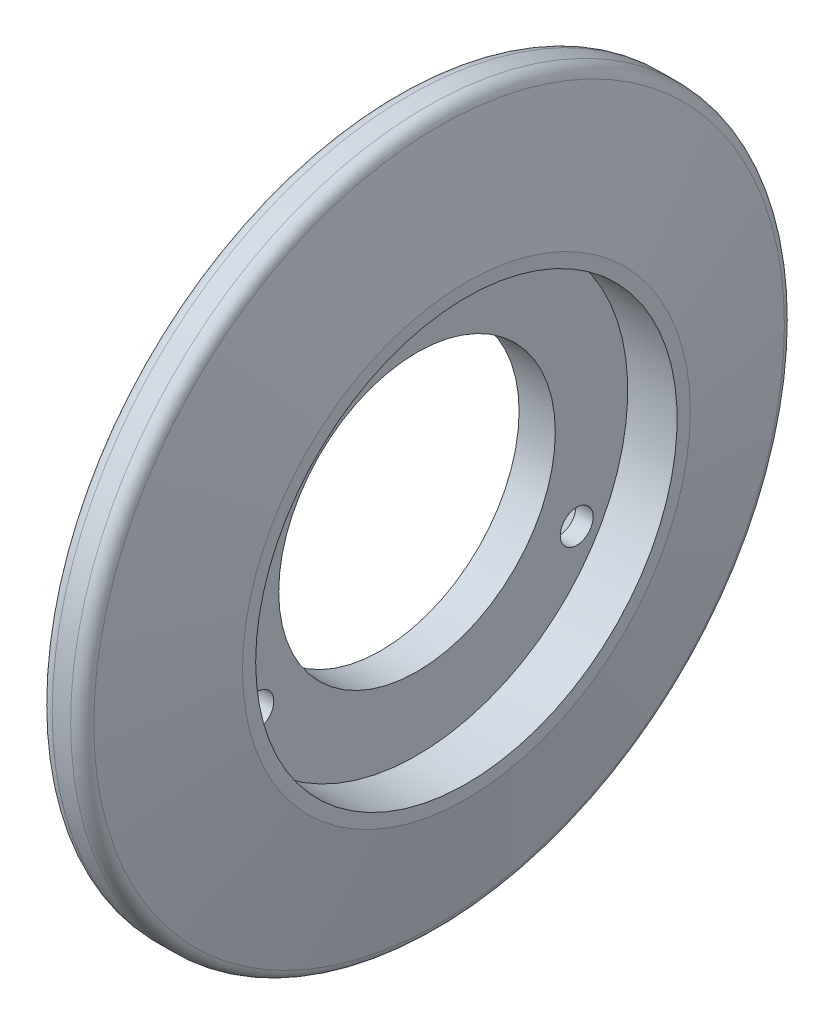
ISO-10303-21;
HEADER;
FILE_DESCRIPTION(('STEP AP214'),'2;1');
FILE_NAME('part.step','',(''),(''),'','','');
FILE_SCHEMA(('AUTOMOTIVE_DESIGN { 1 0 10303 214 1 1 1 1 }'));
ENDSEC;
DATA;
#1=APPLICATION_CONTEXT('core data for automotive mechanical design processes');
#2=APPLICATION_PROTOCOL_DEFINITION('international standard','automotive_design',2000,#1);
#3=PRODUCT_CONTEXT('',#1,'mechanical');
#4=PRODUCT('Part','Part','',(#3));
#5=PRODUCT_RELATED_PRODUCT_CATEGORY('part','',(#4));
#6=PRODUCT_DEFINITION_FORMATION('','',#4);
#7=PRODUCT_DEFINITION_CONTEXT('part definition',#1,'design');
#8=PRODUCT_DEFINITION('design','',#6,#7);
#9=PRODUCT_DEFINITION_SHAPE('','',#8);
#10=(LENGTH_UNIT() NAMED_UNIT(*) SI_UNIT(.MILLI.,.METRE.));
#11=(NAMED_UNIT(*) PLANE_ANGLE_UNIT() SI_UNIT($,.RADIAN.));
#12=(NAMED_UNIT(*) SI_UNIT($,.STERADIAN.) SOLID_ANGLE_UNIT());
#13=UNCERTAINTY_MEASURE_WITH_UNIT(LENGTH_MEASURE(1.E-05),#10,'distance_accuracy_value','');
#14=(GEOMETRIC_REPRESENTATION_CONTEXT(3) GLOBAL_UNCERTAINTY_ASSIGNED_CONTEXT((#13)) GLOBAL_UNIT_ASSIGNED_CONTEXT((#10,
#11,#12)) REPRESENTATION_CONTEXT('',''));
#15=CARTESIAN_POINT('',(0.,0.,0.));
#16=DIRECTION('',(0.,0.,1.));
#17=DIRECTION('',(1.,0.,0.));
#18=AXIS2_PLACEMENT_3D('',#15,#16,#17);
#19=CARTESIAN_POINT('',(5.50000000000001,-33.,0.));
#20=DIRECTION('',(-1.,0.,0.));
#21=DIRECTION('',(0.,0.,1.));
#22=AXIS2_PLACEMENT_3D('',#19,#20,#21);
#23=PLANE('',#22);
#24=CARTESIAN_POINT('',(5.50000000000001,0.,0.));
#25=DIRECTION('',(-1.,0.,0.));
#26=DIRECTION('',(0.,0.,1.));
#27=AXIS2_PLACEMENT_3D('',#24,#25,#26);
#28=CIRCLE('',#27,34.);
#29=CARTESIAN_POINT('',(5.50000000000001,0.,34.));
#30=VERTEX_POINT('',#29);
#31=EDGE_CURVE('E105',#30,#30,#28,.T.);
#32=ORIENTED_EDGE('',*,*,#31,.T.);
#33=EDGE_LOOP('',(#32));
#34=FACE_BOUND('',#33,.T.);
#35=CARTESIAN_POINT('',(5.50000000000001,0.,0.));
#36=DIRECTION('',(-1.,0.,0.));
#37=DIRECTION('',(0.,0.,1.));
#38=AXIS2_PLACEMENT_3D('',#35,#36,#37);
#39=CIRCLE('',#38,33.);
#40=CARTESIAN_POINT('',(5.50000000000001,0.,33.));
#41=VERTEX_POINT('',#40);
#42=EDGE_CURVE('E72',#41,#41,#39,.T.);
#43=ORIENTED_EDGE('',*,*,#42,.F.);
#44=EDGE_LOOP('',(#43));
#45=FACE_BOUND('',#44,.T.);
#46=ADVANCED_FACE('F35',(#34,#45),#23,.T.);
#47=CARTESIAN_POINT('',(5.50000000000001,0.,0.));
#48=DIRECTION('',(1.,0.,0.));
#49=DIRECTION('',(0.,0.,-1.));
#50=AXIS2_PLACEMENT_3D('',#47,#48,#49);
#51=CONICAL_SURFACE('',#50,34.,1.34948188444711);
#52=CARTESIAN_POINT('',(9.64878048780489,0.,0.));
#53=DIRECTION('',(-1.,0.,0.));
#54=DIRECTION('',(0.,0.,1.));
#55=AXIS2_PLACEMENT_3D('',#52,#53,#54);
#56=CIRCLE('',#55,52.4390243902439);
#57=CARTESIAN_POINT('',(9.64878048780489,0.,52.4390243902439));
#58=VERTEX_POINT('',#57);
#59=EDGE_CURVE('E11',#58,#58,#56,.T.);
#60=ORIENTED_EDGE('',*,*,#59,.T.);
#61=EDGE_LOOP('',(#60));
#62=FACE_BOUND('',#61,.T.);
#63=ORIENTED_EDGE('',*,*,#31,.F.);
#64=EDGE_LOOP('',(#63));
#65=FACE_BOUND('',#64,.T.);
#66=ADVANCED_FACE('F152',(#62,#65),#51,.T.);
#67=CARTESIAN_POINT('',(-40.,0.,0.));
#68=DIRECTION('',(-1.,0.,0.));
#69=DIRECTION('',(0.,0.,1.));
#70=AXIS2_PLACEMENT_3D('',#67,#68,#69);
#71=CYLINDRICAL_SURFACE('',#70,54.);
#72=CARTESIAN_POINT('',(14.4,0.,0.));
#73=DIRECTION('',(1.,0.,0.));
#74=DIRECTION('',(0.,0.,-1.));
#75=AXIS2_PLACEMENT_3D('',#72,#73,#74);
#76=CIRCLE('',#75,54.);
#77=CARTESIAN_POINT('',(14.4,0.,-54.));
#78=VERTEX_POINT('',#77);
#79=EDGE_CURVE('E111',#78,#78,#76,.F.);
#80=ORIENTED_EDGE('',*,*,#79,.T.);
#81=EDGE_LOOP('',(#80));
#82=FACE_BOUND('',#81,.T.);
#83=CARTESIAN_POINT('',(11.6,0.,0.));
#84=DIRECTION('',(1.,0.,0.));
#85=DIRECTION('',(0.,0.,-1.));
#86=AXIS2_PLACEMENT_3D('',#83,#84,#85);
#87=CIRCLE('',#86,54.);
#88=CARTESIAN_POINT('',(11.6,0.,-54.));
#89=VERTEX_POINT('',#88);
#90=EDGE_CURVE('E108',#89,#89,#87,.T.);
#91=ORIENTED_EDGE('',*,*,#90,.T.);
#92=EDGE_LOOP('',(#91));
#93=FACE_BOUND('',#92,.T.);
#94=ADVANCED_FACE('F146',(#82,#93),#71,.T.);
#95=CARTESIAN_POINT('',(16.,0.,0.));
#96=DIRECTION('',(-1.,0.,0.));
#97=DIRECTION('',(0.,0.,1.));
#98=AXIS2_PLACEMENT_3D('',#95,#96,#97);
#99=CONICAL_SURFACE('',#98,54.,1.34948188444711);
#100=CARTESIAN_POINT('',(16.3512195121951,0.,0.));
#101=DIRECTION('',(1.,0.,0.));
#102=DIRECTION('',(0.,0.,-1.));
#103=AXIS2_PLACEMENT_3D('',#100,#101,#102);
#104=CIRCLE('',#103,52.4390243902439);
#105=CARTESIAN_POINT('',(16.3512195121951,0.,-52.4390243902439));
#106=VERTEX_POINT('',#105);
#107=EDGE_CURVE('E44',#106,#106,#104,.T.);
#108=ORIENTED_EDGE('',*,*,#107,.T.);
#109=EDGE_LOOP('',(#108));
#110=FACE_BOUND('',#109,.T.);
#111=CARTESIAN_POINT('',(20.5,0.,0.));
#112=DIRECTION('',(-1.,0.,0.));
#113=DIRECTION('',(0.,0.,1.));
#114=AXIS2_PLACEMENT_3D('',#111,#112,#113);
#115=CIRCLE('',#114,34.);
#116=CARTESIAN_POINT('',(20.5,0.,34.));
#117=VERTEX_POINT('',#116);
#118=EDGE_CURVE('E102',#117,#117,#115,.T.);
#119=ORIENTED_EDGE('',*,*,#118,.T.);
#120=EDGE_LOOP('',(#119));
#121=FACE_BOUND('',#120,.T.);
#122=ADVANCED_FACE('F141',(#110,#121),#99,.T.);
#123=CARTESIAN_POINT('',(20.5,-34.,0.));
#124=DIRECTION('',(1.,0.,0.));
#125=DIRECTION('',(0.,0.,-1.));
#126=AXIS2_PLACEMENT_3D('',#123,#124,#125);
#127=PLANE('',#126);
#128=CARTESIAN_POINT('',(20.5,0.,0.));
#129=DIRECTION('',(-1.,0.,0.));
#130=DIRECTION('',(0.,0.,1.));
#131=AXIS2_PLACEMENT_3D('',#128,#129,#130);
#132=CIRCLE('',#131,32.);
#133=CARTESIAN_POINT('',(20.5,0.,32.));
#134=VERTEX_POINT('',#133);
#135=EDGE_CURVE('E99',#134,#134,#132,.T.);
#136=ORIENTED_EDGE('',*,*,#135,.T.);
#137=EDGE_LOOP('',(#136));
#138=FACE_BOUND('',#137,.T.);
#139=ORIENTED_EDGE('',*,*,#118,.F.);
#140=EDGE_LOOP('',(#139));
#141=FACE_BOUND('',#140,.T.);
#142=ADVANCED_FACE('F135',(#138,#141),#127,.T.);
#143=CARTESIAN_POINT('',(-40.,0.,0.));
#144=DIRECTION('',(-1.,0.,0.));
#145=DIRECTION('',(0.,0.,1.));
#146=AXIS2_PLACEMENT_3D('',#143,#144,#145);
#147=CYLINDRICAL_SURFACE('',#146,32.);
#148=CARTESIAN_POINT('',(13.,0.,0.));
#149=DIRECTION('',(-1.,0.,0.));
#150=DIRECTION('',(0.,0.,1.));
#151=AXIS2_PLACEMENT_3D('',#148,#149,#150);
#152=CIRCLE('',#151,32.);
#153=CARTESIAN_POINT('',(13.,0.,32.));
#154=VERTEX_POINT('',#153);
#155=EDGE_CURVE('E96',#154,#154,#152,.T.);
#156=ORIENTED_EDGE('',*,*,#155,.T.);
#157=EDGE_LOOP('',(#156));
#158=FACE_BOUND('',#157,.T.);
#159=ORIENTED_EDGE('',*,*,#135,.F.);
#160=EDGE_LOOP('',(#159));
#161=FACE_BOUND('',#160,.T.);
#162=ADVANCED_FACE('F126',(#158,#161),#147,.F.);
#163=CARTESIAN_POINT('',(13.,-32.,0.));
#164=DIRECTION('',(1.,0.,0.));
#165=DIRECTION('',(0.,0.,-1.));
#166=AXIS2_PLACEMENT_3D('',#163,#164,#165);
#167=PLANE('',#166);
#168=CARTESIAN_POINT('',(13.,-13.9999999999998,24.2487113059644));
#169=DIRECTION('',(1.,0.,0.));
#170=DIRECTION('',(0.,0.,-1.));
#171=AXIS2_PLACEMENT_3D('',#168,#169,#170);
#172=CIRCLE('',#171,2.50000000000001);
#173=CARTESIAN_POINT('',(13.,-13.9999999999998,21.7487113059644));
#174=VERTEX_POINT('',#173);
#175=EDGE_CURVE('E39',#174,#174,#172,.T.);
#176=ORIENTED_EDGE('',*,*,#175,.F.);
#177=EDGE_LOOP('',(#176));
#178=FACE_BOUND('',#177,.T.);
#179=CARTESIAN_POINT('',(13.,-14.0000000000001,-24.2487113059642));
#180=DIRECTION('',(1.,0.,0.));
#181=DIRECTION('',(0.,0.,-1.));
#182=AXIS2_PLACEMENT_3D('',#179,#180,#181);
#183=CIRCLE('',#182,2.50000000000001);
#184=CARTESIAN_POINT('',(13.,-14.0000000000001,-26.7487113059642));
#185=VERTEX_POINT('',#184);
#186=EDGE_CURVE('E78',#185,#185,#183,.T.);
#187=ORIENTED_EDGE('',*,*,#186,.F.);
#188=EDGE_LOOP('',(#187));
#189=FACE_BOUND('',#188,.T.);
#190=CARTESIAN_POINT('',(13.,28.,0.));
#191=DIRECTION('',(1.,0.,0.));
#192=DIRECTION('',(0.,0.,-1.));
#193=AXIS2_PLACEMENT_3D('',#190,#191,#192);
#194=CIRCLE('',#193,2.50000000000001);
#195=CARTESIAN_POINT('',(13.,28.,-2.50000000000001));
#196=VERTEX_POINT('',#195);
#197=EDGE_CURVE('E81',#196,#196,#194,.T.);
#198=ORIENTED_EDGE('',*,*,#197,.F.);
#199=EDGE_LOOP('',(#198));
#200=FACE_BOUND('',#199,.T.);
#201=CARTESIAN_POINT('',(13.,0.,0.));
#202=DIRECTION('',(-1.,0.,0.));
#203=DIRECTION('',(0.,0.,1.));
#204=AXIS2_PLACEMENT_3D('',#201,#202,#203);
#205=CIRCLE('',#204,21.);
#206=CARTESIAN_POINT('',(13.,0.,21.));
#207=VERTEX_POINT('',#206);
#208=EDGE_CURVE('E93',#207,#207,#205,.T.);
#209=ORIENTED_EDGE('',*,*,#208,.T.);
#210=EDGE_LOOP('',(#209));
#211=FACE_BOUND('',#210,.T.);
#212=ORIENTED_EDGE('',*,*,#155,.F.);
#213=EDGE_LOOP('',(#212));
#214=FACE_BOUND('',#213,.T.);
#215=ADVANCED_FACE('F122',(#178,#189,#200,#211,#214),#167,.T.);
#216=CARTESIAN_POINT('',(-40.,0.,0.));
#217=DIRECTION('',(-1.,0.,0.));
#218=DIRECTION('',(0.,0.,1.));
#219=AXIS2_PLACEMENT_3D('',#216,#217,#218);
#220=CYLINDRICAL_SURFACE('',#219,21.);
#221=CARTESIAN_POINT('',(7.50000000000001,0.,0.));
#222=DIRECTION('',(-1.,0.,0.));
#223=DIRECTION('',(0.,0.,1.));
#224=AXIS2_PLACEMENT_3D('',#221,#222,#223);
#225=CIRCLE('',#224,21.);
#226=CARTESIAN_POINT('',(7.50000000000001,0.,21.));
#227=VERTEX_POINT('',#226);
#228=EDGE_CURVE('E90',#227,#227,#225,.T.);
#229=ORIENTED_EDGE('',*,*,#228,.T.);
#230=EDGE_LOOP('',(#229));
#231=FACE_BOUND('',#230,.T.);
#232=ORIENTED_EDGE('',*,*,#208,.F.);
#233=EDGE_LOOP('',(#232));
#234=FACE_BOUND('',#233,.T.);
#235=ADVANCED_FACE('F125',(#231,#234),#220,.F.);
#236=CARTESIAN_POINT('',(7.50000000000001,-21.,0.));
#237=DIRECTION('',(-1.,0.,0.));
#238=DIRECTION('',(0.,0.,1.));
#239=AXIS2_PLACEMENT_3D('',#236,#237,#238);
#240=PLANE('',#239);
#241=CARTESIAN_POINT('',(7.50000000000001,0.,0.));
#242=DIRECTION('',(-1.,0.,0.));
#243=DIRECTION('',(0.,0.,1.));
#244=AXIS2_PLACEMENT_3D('',#241,#242,#243);
#245=CIRCLE('',#244,33.);
#246=CARTESIAN_POINT('',(7.50000000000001,-16.5000000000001,-28.5788383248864));
#247=VERTEX_POINT('',#246);
#248=CARTESIAN_POINT('',(7.50000000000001,-16.4999999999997,28.5788383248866));
#249=VERTEX_POINT('',#248);
#250=EDGE_CURVE('E71',#247,#249,#245,.T.);
#251=ORIENTED_EDGE('',*,*,#250,.T.);
#252=CARTESIAN_POINT('',(7.50000000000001,-13.9999999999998,24.2487113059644));
#253=DIRECTION('',(-1.,0.,0.));
#254=DIRECTION('',(0.,0.,1.));
#255=AXIS2_PLACEMENT_3D('',#252,#253,#254);
#256=CIRCLE('',#255,5.);
#257=EDGE_CURVE('E50',#249,#249,#256,.T.);
#258=ORIENTED_EDGE('',*,*,#257,.F.);
#259=CARTESIAN_POINT('',(7.50000000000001,33.,0.));
#260=VERTEX_POINT('',#259);
#261=EDGE_CURVE('E61',#249,#260,#245,.T.);
#262=ORIENTED_EDGE('',*,*,#261,.T.);
#263=CARTESIAN_POINT('',(7.50000000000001,28.,0.));
#264=DIRECTION('',(-1.,0.,0.));
#265=DIRECTION('',(0.,0.,1.));
#266=AXIS2_PLACEMENT_3D('',#263,#264,#265);
#267=CIRCLE('',#266,5.);
#268=EDGE_CURVE('E67',#260,#260,#267,.T.);
#269=ORIENTED_EDGE('',*,*,#268,.F.);
#270=EDGE_CURVE('E74',#260,#247,#245,.T.);
#271=ORIENTED_EDGE('',*,*,#270,.T.);
#272=CARTESIAN_POINT('',(7.50000000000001,-14.0000000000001,-24.2487113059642));
#273=DIRECTION('',(-1.,0.,0.));
#274=DIRECTION('',(0.,0.,1.));
#275=AXIS2_PLACEMENT_3D('',#272,#273,#274);
#276=CIRCLE('',#275,5.);
#277=EDGE_CURVE('E55',#247,#247,#276,.T.);
#278=ORIENTED_EDGE('',*,*,#277,.F.);
#279=EDGE_LOOP('',(#251,#258,#262,#269,#271,#278));
#280=FACE_BOUND('',#279,.T.);
#281=ORIENTED_EDGE('',*,*,#228,.F.);
#282=EDGE_LOOP('',(#281));
#283=FACE_BOUND('',#282,.T.);
#284=ADVANCED_FACE('F64',(#280,#283),#240,.T.);
#285=CARTESIAN_POINT('',(-40.,0.,0.));
#286=DIRECTION('',(-1.,0.,0.));
#287=DIRECTION('',(0.,0.,1.));
#288=AXIS2_PLACEMENT_3D('',#285,#286,#287);
#289=CYLINDRICAL_SURFACE('',#288,33.);
#290=ORIENTED_EDGE('',*,*,#42,.T.);
#291=EDGE_LOOP('',(#290));
#292=FACE_BOUND('',#291,.T.);
#293=ORIENTED_EDGE('',*,*,#270,.F.);
#294=ORIENTED_EDGE('',*,*,#261,.F.);
#295=ORIENTED_EDGE('',*,*,#250,.F.);
#296=EDGE_LOOP('',(#293,#294,#295));
#297=FACE_BOUND('',#296,.T.);
#298=ADVANCED_FACE('F166',(#292,#297),#289,.F.);
#299=CARTESIAN_POINT('',(14.4,0.,0.));
#300=DIRECTION('',(1.,0.,0.));
#301=DIRECTION('',(0.,0.,-1.));
#302=AXIS2_PLACEMENT_3D('',#299,#300,#301);
#303=TOROIDAL_SURFACE('',#302,52.,2.);
#304=ORIENTED_EDGE('',*,*,#107,.F.);
#305=EDGE_LOOP('',(#304));
#306=FACE_BOUND('',#305,.T.);
#307=ORIENTED_EDGE('',*,*,#79,.F.);
#308=EDGE_LOOP('',(#307));
#309=FACE_BOUND('',#308,.T.);
#310=ADVANCED_FACE('F164',(#306,#309),#303,.T.);
#311=CARTESIAN_POINT('',(11.6,0.,0.));
#312=DIRECTION('',(1.,0.,0.));
#313=DIRECTION('',(0.,0.,-1.));
#314=AXIS2_PLACEMENT_3D('',#311,#312,#313);
#315=TOROIDAL_SURFACE('',#314,52.,2.);
#316=ORIENTED_EDGE('',*,*,#90,.F.);
#317=EDGE_LOOP('',(#316));
#318=FACE_BOUND('',#317,.T.);
#319=ORIENTED_EDGE('',*,*,#59,.F.);
#320=EDGE_LOOP('',(#319));
#321=FACE_BOUND('',#320,.T.);
#322=ADVANCED_FACE('F37',(#318,#321),#315,.T.);
#323=CARTESIAN_POINT('',(7.50000000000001,28.,0.));
#324=DIRECTION('',(-1.,0.,0.));
#325=DIRECTION('',(0.,0.,1.));
#326=AXIS2_PLACEMENT_3D('',#323,#324,#325);
#327=CYLINDRICAL_SURFACE('',#326,2.50000000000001);
#328=ORIENTED_EDGE('',*,*,#197,.T.);
#329=EDGE_LOOP('',(#328));
#330=FACE_BOUND('',#329,.T.);
#331=CARTESIAN_POINT('',(10.3759210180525,28.,0.));
#332=DIRECTION('',(-1.,0.,0.));
#333=DIRECTION('',(0.,0.,1.));
#334=AXIS2_PLACEMENT_3D('',#331,#332,#333);
#335=CIRCLE('',#334,2.50000000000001);
#336=CARTESIAN_POINT('',(10.3759210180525,28.,2.50000000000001));
#337=VERTEX_POINT('',#336);
#338=EDGE_CURVE('E77',#337,#337,#335,.T.);
#339=ORIENTED_EDGE('',*,*,#338,.T.);
#340=EDGE_LOOP('',(#339));
#341=FACE_BOUND('',#340,.T.);
#342=ADVANCED_FACE('F119',(#330,#341),#327,.F.);
#343=CARTESIAN_POINT('',(7.50000000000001,28.,0.));
#344=DIRECTION('',(-1.,0.,0.));
#345=DIRECTION('',(0.,0.,1.));
#346=AXIS2_PLACEMENT_3D('',#343,#344,#345);
#347=CONICAL_SURFACE('',#346,5.,0.715584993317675);
#348=ORIENTED_EDGE('',*,*,#338,.F.);
#349=EDGE_LOOP('',(#348));
#350=FACE_BOUND('',#349,.T.);
#351=ORIENTED_EDGE('',*,*,#268,.T.);
#352=EDGE_LOOP('',(#351));
#353=FACE_BOUND('',#352,.T.);
#354=ADVANCED_FACE('F76',(#350,#353),#347,.F.);
#355=CARTESIAN_POINT('',(7.50000000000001,-14.0000000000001,-24.2487113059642));
#356=DIRECTION('',(-1.,0.,0.));
#357=DIRECTION('',(0.,0.,1.));
#358=AXIS2_PLACEMENT_3D('',#355,#356,#357);
#359=CYLINDRICAL_SURFACE('',#358,2.50000000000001);
#360=ORIENTED_EDGE('',*,*,#186,.T.);
#361=EDGE_LOOP('',(#360));
#362=FACE_BOUND('',#361,.T.);
#363=CARTESIAN_POINT('',(10.3759210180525,-14.0000000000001,-24.2487113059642));
#364=DIRECTION('',(-1.,0.,0.));
#365=DIRECTION('',(0.,0.,1.));
#366=AXIS2_PLACEMENT_3D('',#363,#364,#365);
#367=CIRCLE('',#366,2.50000000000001);
#368=CARTESIAN_POINT('',(10.3759210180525,-14.0000000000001,-21.7487113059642));
#369=VERTEX_POINT('',#368);
#370=EDGE_CURVE('E84',#369,#369,#367,.T.);
#371=ORIENTED_EDGE('',*,*,#370,.T.);
#372=EDGE_LOOP('',(#371));
#373=FACE_BOUND('',#372,.T.);
#374=ADVANCED_FACE('F218',(#362,#373),#359,.F.);
#375=CARTESIAN_POINT('',(7.50000000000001,-14.0000000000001,-24.2487113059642));
#376=DIRECTION('',(-1.,0.,0.));
#377=DIRECTION('',(0.,0.,1.));
#378=AXIS2_PLACEMENT_3D('',#375,#376,#377);
#379=CONICAL_SURFACE('',#378,5.,0.715584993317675);
#380=ORIENTED_EDGE('',*,*,#370,.F.);
#381=EDGE_LOOP('',(#380));
#382=FACE_BOUND('',#381,.T.);
#383=ORIENTED_EDGE('',*,*,#277,.T.);
#384=EDGE_LOOP('',(#383));
#385=FACE_BOUND('',#384,.T.);
#386=ADVANCED_FACE('F223',(#382,#385),#379,.F.);
#387=CARTESIAN_POINT('',(7.50000000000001,-13.9999999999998,24.2487113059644));
#388=DIRECTION('',(-1.,0.,0.));
#389=DIRECTION('',(0.,0.,1.));
#390=AXIS2_PLACEMENT_3D('',#387,#388,#389);
#391=CYLINDRICAL_SURFACE('',#390,2.50000000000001);
#392=ORIENTED_EDGE('',*,*,#175,.T.);
#393=EDGE_LOOP('',(#392));
#394=FACE_BOUND('',#393,.T.);
#395=CARTESIAN_POINT('',(10.3759210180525,-13.9999999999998,24.2487113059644));
#396=DIRECTION('',(-1.,0.,0.));
#397=DIRECTION('',(0.,0.,1.));
#398=AXIS2_PLACEMENT_3D('',#395,#396,#397);
#399=CIRCLE('',#398,2.50000000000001);
#400=CARTESIAN_POINT('',(10.3759210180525,-13.9999999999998,26.7487113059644));
#401=VERTEX_POINT('',#400);
#402=EDGE_CURVE('E317',#401,#401,#399,.T.);
#403=ORIENTED_EDGE('',*,*,#402,.T.);
#404=EDGE_LOOP('',(#403));
#405=FACE_BOUND('',#404,.T.);
#406=ADVANCED_FACE('F235',(#394,#405),#391,.F.);
#407=CARTESIAN_POINT('',(7.50000000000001,-13.9999999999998,24.2487113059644));
#408=DIRECTION('',(-1.,0.,0.));
#409=DIRECTION('',(0.,0.,1.));
#410=AXIS2_PLACEMENT_3D('',#407,#408,#409);
#411=CONICAL_SURFACE('',#410,5.,0.715584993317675);
#412=ORIENTED_EDGE('',*,*,#402,.F.);
#413=EDGE_LOOP('',(#412));
#414=FACE_BOUND('',#413,.T.);
#415=ORIENTED_EDGE('',*,*,#257,.T.);
#416=EDGE_LOOP('',(#415));
#417=FACE_BOUND('',#416,.T.);
#418=ADVANCED_FACE('F245',(#414,#417),#411,.F.);
#419=CLOSED_SHELL('',(#46,#66,#94,#122,#142,#162,#215,#235,#284,#298,#310,#322,#342,#354,#374,
#386,#406,#418));
#420=MANIFOLD_SOLID_BREP('B2',#419);
#421=ADVANCED_BREP_SHAPE_REPRESENTATION('',(#18,#420),#14);
#422=SHAPE_DEFINITION_REPRESENTATION(#9,#421);
ENDSEC;
END-ISO-10303-21;
